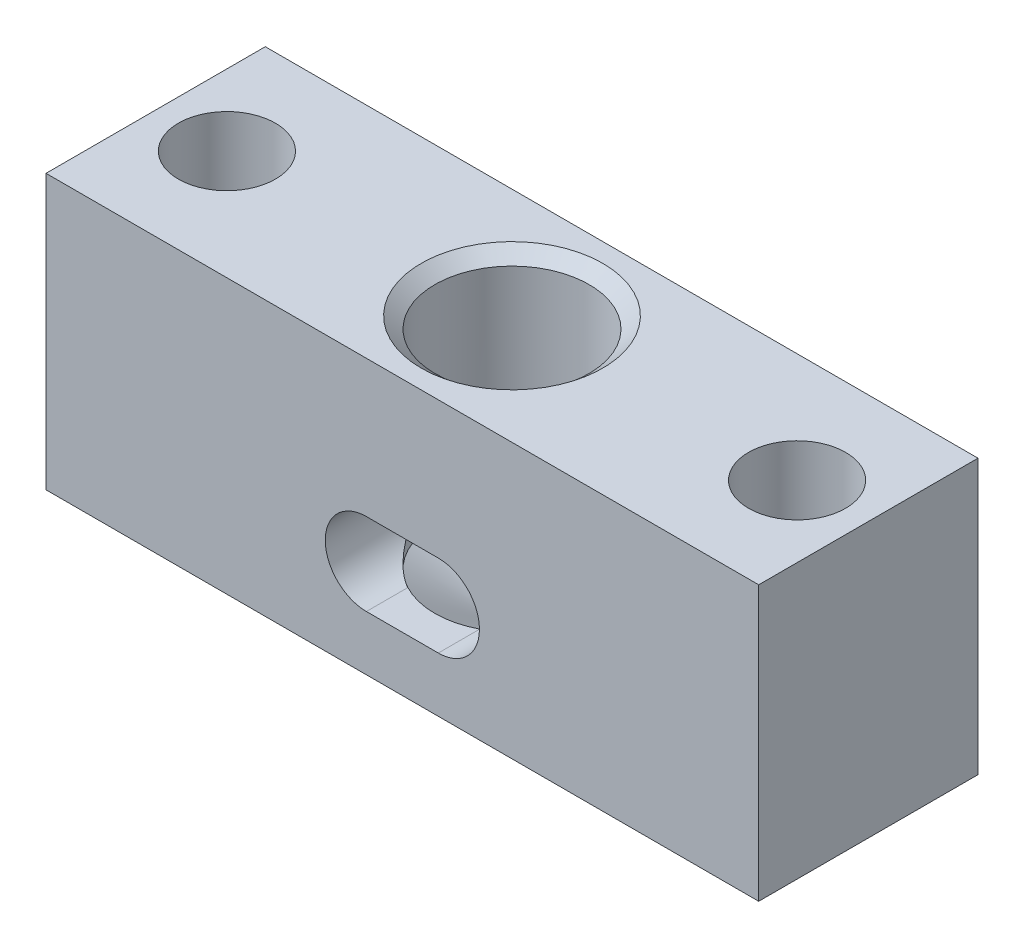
ISO-10303-21;
HEADER;
FILE_DESCRIPTION(('STEP AP214'),'2;1');
FILE_NAME('part.step','',(''),(''),'','','');
FILE_SCHEMA(('AUTOMOTIVE_DESIGN { 1 0 10303 214 1 1 1 1 }'));
ENDSEC;
DATA;
#1=APPLICATION_CONTEXT('core data for automotive mechanical design processes');
#2=APPLICATION_PROTOCOL_DEFINITION('international standard','automotive_design',2000,#1);
#3=PRODUCT_CONTEXT('',#1,'mechanical');
#4=PRODUCT('Part','Part','',(#3));
#5=PRODUCT_RELATED_PRODUCT_CATEGORY('part','',(#4));
#6=PRODUCT_DEFINITION_FORMATION('','',#4);
#7=PRODUCT_DEFINITION_CONTEXT('part definition',#1,'design');
#8=PRODUCT_DEFINITION('design','',#6,#7);
#9=PRODUCT_DEFINITION_SHAPE('','',#8);
#10=(LENGTH_UNIT() NAMED_UNIT(*) SI_UNIT(.MILLI.,.METRE.));
#11=(NAMED_UNIT(*) PLANE_ANGLE_UNIT() SI_UNIT($,.RADIAN.));
#12=(NAMED_UNIT(*) SI_UNIT($,.STERADIAN.) SOLID_ANGLE_UNIT());
#13=UNCERTAINTY_MEASURE_WITH_UNIT(LENGTH_MEASURE(1.E-05),#10,'distance_accuracy_value','');
#14=(GEOMETRIC_REPRESENTATION_CONTEXT(3) GLOBAL_UNCERTAINTY_ASSIGNED_CONTEXT((#13)) GLOBAL_UNIT_ASSIGNED_CONTEXT((#10,
#11,#12)) REPRESENTATION_CONTEXT('',''));
#15=CARTESIAN_POINT('',(0.,0.,0.));
#16=DIRECTION('',(0.,0.,1.));
#17=DIRECTION('',(1.,0.,0.));
#18=AXIS2_PLACEMENT_3D('',#15,#16,#17);
#19=CARTESIAN_POINT('',(-29.3592068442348,20.1742035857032,10.16));
#20=DIRECTION('',(1.,0.,0.));
#21=DIRECTION('',(0.,0.,-1.));
#22=AXIS2_PLACEMENT_3D('',#19,#20,#21);
#23=PLANE('',#22);
#24=DIRECTION('',(0.,-1.,0.));
#25=VECTOR('',#24,1.);
#26=CARTESIAN_POINT('',(-29.3592068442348,20.1742035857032,0.));
#27=LINE('',#26,#25);
#28=CARTESIAN_POINT('',(-29.3592068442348,20.1742035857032,0.));
#29=VERTEX_POINT('',#28);
#30=CARTESIAN_POINT('',(-29.3592068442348,7.47420358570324,0.));
#31=VERTEX_POINT('',#30);
#32=EDGE_CURVE('E230',#29,#31,#27,.T.);
#33=ORIENTED_EDGE('',*,*,#32,.T.);
#34=DIRECTION('',(0.,0.,-1.));
#35=VECTOR('',#34,1.);
#36=CARTESIAN_POINT('',(-29.3592068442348,7.47420358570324,10.16));
#37=LINE('',#36,#35);
#38=CARTESIAN_POINT('',(-29.3592068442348,7.47420358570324,10.16));
#39=VERTEX_POINT('',#38);
#40=EDGE_CURVE('E268',#39,#31,#37,.T.);
#41=ORIENTED_EDGE('',*,*,#40,.F.);
#42=DIRECTION('',(0.,-1.,0.));
#43=VECTOR('',#42,1.);
#44=CARTESIAN_POINT('',(-29.3592068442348,20.1742035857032,10.16));
#45=LINE('',#44,#43);
#46=CARTESIAN_POINT('',(-29.3592068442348,20.1742035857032,10.16));
#47=VERTEX_POINT('',#46);
#48=EDGE_CURVE('E231',#47,#39,#45,.T.);
#49=ORIENTED_EDGE('',*,*,#48,.F.);
#50=DIRECTION('',(0.,0.,-1.));
#51=VECTOR('',#50,1.);
#52=CARTESIAN_POINT('',(-29.3592068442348,20.1742035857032,10.16));
#53=LINE('',#52,#51);
#54=EDGE_CURVE('E245',#47,#29,#53,.T.);
#55=ORIENTED_EDGE('',*,*,#54,.T.);
#56=EDGE_LOOP('',(#33,#41,#49,#55));
#57=FACE_BOUND('',#56,.T.);
#58=ADVANCED_FACE('F42',(#57),#23,.F.);
#59=CARTESIAN_POINT('',(-29.3592068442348,7.47420358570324,10.16));
#60=DIRECTION('',(0.,1.,0.));
#61=DIRECTION('',(0.,0.,1.));
#62=AXIS2_PLACEMENT_3D('',#59,#60,#61);
#63=PLANE('',#62);
#64=CARTESIAN_POINT('',(-26.0572068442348,7.47420358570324,5.08));
#65=DIRECTION('',(0.,1.,0.));
#66=DIRECTION('',(0.,0.,1.));
#67=AXIS2_PLACEMENT_3D('',#64,#65,#66);
#68=CIRCLE('',#67,2.2479);
#69=CARTESIAN_POINT('',(-26.0572068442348,7.47420358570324,7.3279));
#70=VERTEX_POINT('',#69);
#71=EDGE_CURVE('E218',#70,#70,#68,.T.);
#72=ORIENTED_EDGE('',*,*,#71,.T.);
#73=EDGE_LOOP('',(#72));
#74=FACE_BOUND('',#73,.T.);
#75=CARTESIAN_POINT('',(0.358793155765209,7.47420358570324,5.08));
#76=DIRECTION('',(0.,1.,0.));
#77=DIRECTION('',(0.,0.,1.));
#78=AXIS2_PLACEMENT_3D('',#75,#76,#77);
#79=CIRCLE('',#78,2.2479);
#80=CARTESIAN_POINT('',(0.358793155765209,7.47420358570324,7.3279));
#81=VERTEX_POINT('',#80);
#82=EDGE_CURVE('E226',#81,#81,#79,.T.);
#83=ORIENTED_EDGE('',*,*,#82,.T.);
#84=EDGE_LOOP('',(#83));
#85=FACE_BOUND('',#84,.T.);
#86=DIRECTION('',(1.,0.,0.));
#87=VECTOR('',#86,1.);
#88=CARTESIAN_POINT('',(-29.3592068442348,7.47420358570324,0.));
#89=LINE('',#88,#87);
#90=CARTESIAN_POINT('',(3.66079315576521,7.47420358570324,0.));
#91=VERTEX_POINT('',#90);
#92=EDGE_CURVE('E249',#31,#91,#89,.T.);
#93=ORIENTED_EDGE('',*,*,#92,.T.);
#94=DIRECTION('',(0.,0.,-1.));
#95=VECTOR('',#94,1.);
#96=CARTESIAN_POINT('',(3.66079315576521,7.47420358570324,10.16));
#97=LINE('',#96,#95);
#98=CARTESIAN_POINT('',(3.66079315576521,7.47420358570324,10.16));
#99=VERTEX_POINT('',#98);
#100=EDGE_CURVE('E264',#99,#91,#97,.T.);
#101=ORIENTED_EDGE('',*,*,#100,.F.);
#102=DIRECTION('',(1.,0.,0.));
#103=VECTOR('',#102,1.);
#104=CARTESIAN_POINT('',(-29.3592068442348,7.47420358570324,10.16));
#105=LINE('',#104,#103);
#106=EDGE_CURVE('E235',#39,#99,#105,.T.);
#107=ORIENTED_EDGE('',*,*,#106,.F.);
#108=ORIENTED_EDGE('',*,*,#40,.T.);
#109=EDGE_LOOP('',(#93,#101,#107,#108));
#110=FACE_BOUND('',#109,.T.);
#111=ADVANCED_FACE('F326',(#74,#85,#110),#63,.F.);
#112=CARTESIAN_POINT('',(3.66079315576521,20.1742035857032,10.16));
#113=DIRECTION('',(-1.,0.,0.));
#114=DIRECTION('',(0.,0.,1.));
#115=AXIS2_PLACEMENT_3D('',#112,#113,#114);
#116=PLANE('',#115);
#117=DIRECTION('',(0.,1.,0.));
#118=VECTOR('',#117,1.);
#119=CARTESIAN_POINT('',(3.66079315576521,20.1742035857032,0.));
#120=LINE('',#119,#118);
#121=CARTESIAN_POINT('',(3.66079315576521,20.1742035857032,0.));
#122=VERTEX_POINT('',#121);
#123=EDGE_CURVE('E252',#91,#122,#120,.T.);
#124=ORIENTED_EDGE('',*,*,#123,.T.);
#125=DIRECTION('',(0.,0.,-1.));
#126=VECTOR('',#125,1.);
#127=CARTESIAN_POINT('',(3.66079315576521,20.1742035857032,10.16));
#128=LINE('',#127,#126);
#129=CARTESIAN_POINT('',(3.66079315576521,20.1742035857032,10.16));
#130=VERTEX_POINT('',#129);
#131=EDGE_CURVE('E260',#130,#122,#128,.T.);
#132=ORIENTED_EDGE('',*,*,#131,.F.);
#133=DIRECTION('',(0.,1.,0.));
#134=VECTOR('',#133,1.);
#135=CARTESIAN_POINT('',(3.66079315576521,20.1742035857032,10.16));
#136=LINE('',#135,#134);
#137=EDGE_CURVE('E239',#99,#130,#136,.T.);
#138=ORIENTED_EDGE('',*,*,#137,.F.);
#139=ORIENTED_EDGE('',*,*,#100,.T.);
#140=EDGE_LOOP('',(#124,#132,#138,#139));
#141=FACE_BOUND('',#140,.T.);
#142=ADVANCED_FACE('F331',(#141),#116,.F.);
#143=CARTESIAN_POINT('',(-29.3592068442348,20.1742035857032,10.16));
#144=DIRECTION('',(0.,-1.,0.));
#145=DIRECTION('',(0.,0.,-1.));
#146=AXIS2_PLACEMENT_3D('',#143,#144,#145);
#147=PLANE('',#146);
#148=CARTESIAN_POINT('',(-12.8492068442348,20.1742035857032,5.08));
#149=DIRECTION('',(0.,1.,0.));
#150=DIRECTION('',(0.,0.,1.));
#151=AXIS2_PLACEMENT_3D('',#148,#149,#150);
#152=CIRCLE('',#151,4.206875);
#153=CARTESIAN_POINT('',(-12.8492068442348,20.1742035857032,9.286875));
#154=VERTEX_POINT('',#153);
#155=EDGE_CURVE('E192',#154,#154,#152,.T.);
#156=ORIENTED_EDGE('',*,*,#155,.F.);
#157=EDGE_LOOP('',(#156));
#158=FACE_BOUND('',#157,.T.);
#159=CARTESIAN_POINT('',(-26.0572068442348,20.1742035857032,5.08));
#160=DIRECTION('',(0.,1.,0.));
#161=DIRECTION('',(0.,0.,1.));
#162=AXIS2_PLACEMENT_3D('',#159,#160,#161);
#163=CIRCLE('',#162,2.2479);
#164=CARTESIAN_POINT('',(-26.0572068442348,20.1742035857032,7.3279));
#165=VERTEX_POINT('',#164);
#166=EDGE_CURVE('E213',#165,#165,#163,.T.);
#167=ORIENTED_EDGE('',*,*,#166,.F.);
#168=EDGE_LOOP('',(#167));
#169=FACE_BOUND('',#168,.T.);
#170=CARTESIAN_POINT('',(0.358793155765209,20.1742035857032,5.08));
#171=DIRECTION('',(0.,1.,0.));
#172=DIRECTION('',(0.,0.,1.));
#173=AXIS2_PLACEMENT_3D('',#170,#171,#172);
#174=CIRCLE('',#173,2.2479);
#175=CARTESIAN_POINT('',(0.358793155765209,20.1742035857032,7.3279));
#176=VERTEX_POINT('',#175);
#177=EDGE_CURVE('E222',#176,#176,#174,.T.);
#178=ORIENTED_EDGE('',*,*,#177,.F.);
#179=EDGE_LOOP('',(#178));
#180=FACE_BOUND('',#179,.T.);
#181=DIRECTION('',(-1.,0.,0.));
#182=VECTOR('',#181,1.);
#183=CARTESIAN_POINT('',(-29.3592068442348,20.1742035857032,0.));
#184=LINE('',#183,#182);
#185=EDGE_CURVE('E236',#122,#29,#184,.T.);
#186=ORIENTED_EDGE('',*,*,#185,.T.);
#187=ORIENTED_EDGE('',*,*,#54,.F.);
#188=DIRECTION('',(-1.,0.,0.));
#189=VECTOR('',#188,1.);
#190=CARTESIAN_POINT('',(-29.3592068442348,20.1742035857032,10.16));
#191=LINE('',#190,#189);
#192=EDGE_CURVE('E242',#130,#47,#191,.T.);
#193=ORIENTED_EDGE('',*,*,#192,.F.);
#194=ORIENTED_EDGE('',*,*,#131,.T.);
#195=EDGE_LOOP('',(#186,#187,#193,#194));
#196=FACE_BOUND('',#195,.T.);
#197=ADVANCED_FACE('F347',(#158,#169,#180,#196),#147,.F.);
#198=CARTESIAN_POINT('',(0.,0.,10.16));
#199=DIRECTION('',(0.,0.,1.));
#200=DIRECTION('',(1.,0.,0.));
#201=AXIS2_PLACEMENT_3D('',#198,#199,#200);
#202=PLANE('',#201);
#203=CARTESIAN_POINT('',(-14.5154468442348,11.9192035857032,10.16));
#204=DIRECTION('',(0.,0.,1.));
#205=DIRECTION('',(1.,0.,0.));
#206=AXIS2_PLACEMENT_3D('',#203,#204,#205);
#207=CIRCLE('',#206,1.905);
#208=CARTESIAN_POINT('',(-14.5154468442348,13.8242035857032,10.16));
#209=VERTEX_POINT('',#208);
#210=CARTESIAN_POINT('',(-14.5154468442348,10.0142035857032,10.16));
#211=VERTEX_POINT('',#210);
#212=EDGE_CURVE('E63',#209,#211,#207,.T.);
#213=ORIENTED_EDGE('',*,*,#212,.F.);
#214=DIRECTION('',(-1.,0.,0.));
#215=VECTOR('',#214,1.);
#216=CARTESIAN_POINT('',(-14.5154468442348,13.8242035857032,10.16));
#217=LINE('',#216,#215);
#218=CARTESIAN_POINT('',(-11.1829668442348,13.8242035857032,10.16));
#219=VERTEX_POINT('',#218);
#220=EDGE_CURVE('E168',#219,#209,#217,.T.);
#221=ORIENTED_EDGE('',*,*,#220,.F.);
#222=CARTESIAN_POINT('',(-11.1829668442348,11.9192035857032,10.16));
#223=DIRECTION('',(0.,0.,1.));
#224=DIRECTION('',(1.,0.,0.));
#225=AXIS2_PLACEMENT_3D('',#222,#223,#224);
#226=CIRCLE('',#225,1.905);
#227=CARTESIAN_POINT('',(-11.1829668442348,10.0142035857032,10.16));
#228=VERTEX_POINT('',#227);
#229=EDGE_CURVE('E173',#228,#219,#226,.T.);
#230=ORIENTED_EDGE('',*,*,#229,.F.);
#231=DIRECTION('',(1.,0.,0.));
#232=VECTOR('',#231,1.);
#233=CARTESIAN_POINT('',(-14.5154468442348,10.0142035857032,10.16));
#234=LINE('',#233,#232);
#235=EDGE_CURVE('E182',#211,#228,#234,.T.);
#236=ORIENTED_EDGE('',*,*,#235,.F.);
#237=EDGE_LOOP('',(#213,#221,#230,#236));
#238=FACE_BOUND('',#237,.T.);
#239=ORIENTED_EDGE('',*,*,#48,.T.);
#240=ORIENTED_EDGE('',*,*,#106,.T.);
#241=ORIENTED_EDGE('',*,*,#137,.T.);
#242=ORIENTED_EDGE('',*,*,#192,.T.);
#243=EDGE_LOOP('',(#239,#240,#241,#242));
#244=FACE_BOUND('',#243,.T.);
#245=ADVANCED_FACE('F343',(#238,#244),#202,.T.);
#246=CARTESIAN_POINT('',(0.,0.,0.));
#247=DIRECTION('',(0.,0.,1.));
#248=DIRECTION('',(1.,0.,0.));
#249=AXIS2_PLACEMENT_3D('',#246,#247,#248);
#250=PLANE('',#249);
#251=DIRECTION('',(-1.,0.,0.));
#252=VECTOR('',#251,1.);
#253=CARTESIAN_POINT('',(-14.5154468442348,13.8242035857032,0.));
#254=LINE('',#253,#252);
#255=CARTESIAN_POINT('',(-11.1829668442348,13.8242035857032,0.));
#256=VERTEX_POINT('',#255);
#257=CARTESIAN_POINT('',(-14.5154468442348,13.8242035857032,0.));
#258=VERTEX_POINT('',#257);
#259=EDGE_CURVE('E166',#256,#258,#254,.T.);
#260=ORIENTED_EDGE('',*,*,#259,.T.);
#261=CARTESIAN_POINT('',(-14.5154468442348,11.9192035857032,0.));
#262=DIRECTION('',(0.,0.,1.));
#263=DIRECTION('',(1.,0.,0.));
#264=AXIS2_PLACEMENT_3D('',#261,#262,#263);
#265=CIRCLE('',#264,1.905);
#266=CARTESIAN_POINT('',(-14.5154468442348,10.0142035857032,0.));
#267=VERTEX_POINT('',#266);
#268=EDGE_CURVE('E148',#258,#267,#265,.T.);
#269=ORIENTED_EDGE('',*,*,#268,.T.);
#270=DIRECTION('',(1.,0.,0.));
#271=VECTOR('',#270,1.);
#272=CARTESIAN_POINT('',(-14.5154468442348,10.0142035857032,0.));
#273=LINE('',#272,#271);
#274=CARTESIAN_POINT('',(-11.1829668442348,10.0142035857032,0.));
#275=VERTEX_POINT('',#274);
#276=EDGE_CURVE('E157',#267,#275,#273,.T.);
#277=ORIENTED_EDGE('',*,*,#276,.T.);
#278=CARTESIAN_POINT('',(-11.1829668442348,11.9192035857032,0.));
#279=DIRECTION('',(0.,0.,1.));
#280=DIRECTION('',(1.,0.,0.));
#281=AXIS2_PLACEMENT_3D('',#278,#279,#280);
#282=CIRCLE('',#281,1.905);
#283=EDGE_CURVE('E71',#275,#256,#282,.T.);
#284=ORIENTED_EDGE('',*,*,#283,.T.);
#285=EDGE_LOOP('',(#260,#269,#277,#284));
#286=FACE_BOUND('',#285,.T.);
#287=ORIENTED_EDGE('',*,*,#32,.F.);
#288=ORIENTED_EDGE('',*,*,#185,.F.);
#289=ORIENTED_EDGE('',*,*,#123,.F.);
#290=ORIENTED_EDGE('',*,*,#92,.F.);
#291=EDGE_LOOP('',(#287,#288,#289,#290));
#292=FACE_BOUND('',#291,.T.);
#293=ADVANCED_FACE('F163',(#286,#292),#250,.F.);
#294=CARTESIAN_POINT('',(0.358793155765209,20.1742035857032,5.08));
#295=DIRECTION('',(0.,1.,0.));
#296=DIRECTION('',(0.,0.,1.));
#297=AXIS2_PLACEMENT_3D('',#294,#295,#296);
#298=CYLINDRICAL_SURFACE('',#297,2.2479);
#299=ORIENTED_EDGE('',*,*,#82,.F.);
#300=EDGE_LOOP('',(#299));
#301=FACE_BOUND('',#300,.T.);
#302=ORIENTED_EDGE('',*,*,#177,.T.);
#303=EDGE_LOOP('',(#302));
#304=FACE_BOUND('',#303,.T.);
#305=ADVANCED_FACE('F359',(#301,#304),#298,.F.);
#306=CARTESIAN_POINT('',(-26.0572068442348,20.1742035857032,5.08));
#307=DIRECTION('',(0.,1.,0.));
#308=DIRECTION('',(0.,0.,1.));
#309=AXIS2_PLACEMENT_3D('',#306,#307,#308);
#310=CYLINDRICAL_SURFACE('',#309,2.2479);
#311=ORIENTED_EDGE('',*,*,#71,.F.);
#312=EDGE_LOOP('',(#311));
#313=FACE_BOUND('',#312,.T.);
#314=ORIENTED_EDGE('',*,*,#166,.T.);
#315=EDGE_LOOP('',(#314));
#316=FACE_BOUND('',#315,.T.);
#317=ADVANCED_FACE('F365',(#313,#316),#310,.F.);
#318=CARTESIAN_POINT('',(-12.8492068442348,10.0142035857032,5.08));
#319=DIRECTION('',(0.,1.,0.));
#320=DIRECTION('',(0.,0.,1.));
#321=AXIS2_PLACEMENT_3D('',#318,#319,#320);
#322=CONICAL_SURFACE('',#321,3.571875,1.02974425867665);
#323=CARTESIAN_POINT('',(-12.8492068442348,7.86800456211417,5.08));
#324=VERTEX_POINT('',#323);
#325=VERTEX_LOOP('',#324);
#326=FACE_BOUND('',#325,.T.);
#327=CARTESIAN_POINT('',(-12.8492068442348,10.0142035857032,5.08));
#328=DIRECTION('',(0.,1.,0.));
#329=DIRECTION('',(0.,0.,1.));
#330=AXIS2_PLACEMENT_3D('',#327,#328,#329);
#331=CIRCLE('',#330,3.571875);
#332=CARTESIAN_POINT('',(-11.1829668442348,10.0142035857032,8.23942008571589));
#333=VERTEX_POINT('',#332);
#334=CARTESIAN_POINT('',(-11.1829668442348,10.0142035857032,1.92057991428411));
#335=VERTEX_POINT('',#334);
#336=EDGE_CURVE('E209',#333,#335,#331,.T.);
#337=ORIENTED_EDGE('',*,*,#336,.T.);
#338=CARTESIAN_POINT('',(-14.5154468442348,10.0142035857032,1.92057991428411));
#339=VERTEX_POINT('',#338);
#340=EDGE_CURVE('E214',#335,#339,#331,.T.);
#341=ORIENTED_EDGE('',*,*,#340,.T.);
#342=CARTESIAN_POINT('',(-14.5154468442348,10.0142035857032,8.23942008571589));
#343=VERTEX_POINT('',#342);
#344=EDGE_CURVE('E383',#339,#343,#331,.T.);
#345=ORIENTED_EDGE('',*,*,#344,.T.);
#346=EDGE_CURVE('E208',#343,#333,#331,.T.);
#347=ORIENTED_EDGE('',*,*,#346,.T.);
#348=EDGE_LOOP('',(#337,#341,#345,#347));
#349=FACE_BOUND('',#348,.T.);
#350=ADVANCED_FACE('F321',(#326,#349),#322,.F.);
#351=CARTESIAN_POINT('',(-12.8492068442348,20.1742035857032,5.08));
#352=DIRECTION('',(0.,1.,0.));
#353=DIRECTION('',(0.,0.,1.));
#354=AXIS2_PLACEMENT_3D('',#351,#352,#353);
#355=CYLINDRICAL_SURFACE('',#354,3.571875);
#356=ORIENTED_EDGE('',*,*,#344,.F.);
#357=CARTESIAN_POINT('',(-14.5154468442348,10.0142035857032,1.92057991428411));
#358=CARTESIAN_POINT('',(-14.574978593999,10.0142003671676,1.95196004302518));
#359=CARTESIAN_POINT('',(-14.6335671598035,10.0169928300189,1.98502460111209));
#360=CARTESIAN_POINT('',(-14.7483639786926,10.0276203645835,2.05412060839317));
#361=CARTESIAN_POINT('',(-14.8045761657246,10.0354467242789,2.09014683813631));
#362=CARTESIAN_POINT('',(-14.9137719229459,10.0554937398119,2.16449188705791));
#363=CARTESIAN_POINT('',(-14.9667826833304,10.0676685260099,2.20278341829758));
#364=CARTESIAN_POINT('',(-15.0699920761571,10.0959184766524,2.28167367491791));
#365=CARTESIAN_POINT('',(-15.1201891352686,10.1119957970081,2.32227366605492));
#366=CARTESIAN_POINT('',(-15.2953993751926,10.1759774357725,2.47192478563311));
#367=CARTESIAN_POINT('',(-15.4119759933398,10.2337297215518,2.58682105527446));
#368=CARTESIAN_POINT('',(-15.6249942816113,10.3655791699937,2.82628737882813));
#369=CARTESIAN_POINT('',(-15.7213226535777,10.4397637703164,2.95090678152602));
#370=CARTESIAN_POINT('',(-15.8685019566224,10.5756657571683,3.16848153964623));
#371=CARTESIAN_POINT('',(-15.9243708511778,10.6345642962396,3.25987823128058));
#372=CARTESIAN_POINT('',(-16.0267099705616,10.7566798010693,3.44507939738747));
#373=CARTESIAN_POINT('',(-16.0731759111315,10.8198987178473,3.53888494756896));
#374=CARTESIAN_POINT('',(-16.1570087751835,10.9495383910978,3.72816989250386));
#375=CARTESIAN_POINT('',(-16.1943832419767,11.0159564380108,3.8236478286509));
#376=CARTESIAN_POINT('',(-16.2603929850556,11.1511852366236,4.01585021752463));
#377=CARTESIAN_POINT('',(-16.2890314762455,11.2199950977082,4.11257419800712));
#378=CARTESIAN_POINT('',(-16.3381899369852,11.3604265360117,4.30823343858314));
#379=CARTESIAN_POINT('',(-16.3585872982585,11.432074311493,4.40718049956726));
#380=CARTESIAN_POINT('',(-16.3908291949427,11.5764605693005,4.60542083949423));
#381=CARTESIAN_POINT('',(-16.4026879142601,11.6491970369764,4.70471326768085));
#382=CARTESIAN_POINT('',(-16.4127819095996,11.7468575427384,4.83462059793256));
#383=CARTESIAN_POINT('',(-16.4147920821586,11.7705477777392,4.86587676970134));
#384=CARTESIAN_POINT('',(-16.4173280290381,11.8092670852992,4.91524257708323));
#385=CARTESIAN_POINT('',(-16.418125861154,11.8239640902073,4.93360281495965));
#386=CARTESIAN_POINT('',(-16.4191605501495,11.8485844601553,4.96236606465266));
#387=CARTESIAN_POINT('',(-16.4194947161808,11.8581212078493,4.97306749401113));
#388=CARTESIAN_POINT('',(-16.4199058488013,11.8735118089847,4.98820368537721));
#389=CARTESIAN_POINT('',(-16.4200285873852,11.8788786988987,4.99313835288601));
#390=CARTESIAN_POINT('',(-16.4202359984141,11.8902943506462,5.00215019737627));
#391=CARTESIAN_POINT('',(-16.4203211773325,11.896332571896,5.00623836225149));
#392=CARTESIAN_POINT('',(-16.4203977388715,11.9053271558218,5.01008657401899));
#393=CARTESIAN_POINT('',(-16.4204142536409,11.9077801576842,5.01094161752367));
#394=CARTESIAN_POINT('',(-16.4204377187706,11.9127979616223,5.01216635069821));
#395=CARTESIAN_POINT('',(-16.4204447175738,11.9153621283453,5.01253849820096));
#396=CARTESIAN_POINT('',(-16.4204481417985,11.9205315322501,5.01271968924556));
#397=CARTESIAN_POINT('',(-16.4204444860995,11.9231369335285,5.01252441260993));
#398=CARTESIAN_POINT('',(-16.4204270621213,11.9282590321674,5.01160879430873));
#399=CARTESIAN_POINT('',(-16.4204132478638,11.9307752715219,5.01088606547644));
#400=CARTESIAN_POINT('',(-16.4203707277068,11.9365603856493,5.00871872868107));
#401=CARTESIAN_POINT('',(-16.4203384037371,11.9397634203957,5.00710599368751));
#402=CARTESIAN_POINT('',(-16.4202620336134,11.9459141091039,5.00345335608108));
#403=CARTESIAN_POINT('',(-16.4202179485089,11.9488608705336,5.0014120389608));
#404=CARTESIAN_POINT('',(-16.4199730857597,11.9632555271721,4.99060486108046));
#405=CARTESIAN_POINT('',(-16.4197023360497,11.9734023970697,4.9802081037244));
#406=CARTESIAN_POINT('',(-16.4190417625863,11.9929702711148,4.95878098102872));
#407=CARTESIAN_POINT('',(-16.4186511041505,12.0023855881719,4.94774662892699));
#408=CARTESIAN_POINT('',(-16.4164354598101,12.048130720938,4.89273718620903));
#409=CARTESIAN_POINT('',(-16.4137633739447,12.0824337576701,4.8470381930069));
#410=CARTESIAN_POINT('',(-16.4066217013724,12.150758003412,4.75556802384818));
#411=CARTESIAN_POINT('',(-16.4021490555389,12.1847786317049,4.70979685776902));
#412=CARTESIAN_POINT('',(-16.3859319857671,12.2867953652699,4.57161488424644));
#413=CARTESIAN_POINT('',(-16.3714156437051,12.3542062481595,4.47904770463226));
#414=CARTESIAN_POINT('',(-16.3349289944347,12.487774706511,4.29456568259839));
#415=CARTESIAN_POINT('',(-16.31296153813,12.5539327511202,4.20265060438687));
#416=CARTESIAN_POINT('',(-16.2612831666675,12.68474716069,4.01928026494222));
#417=CARTESIAN_POINT('',(-16.2315390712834,12.7493957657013,3.92782872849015));
#418=CARTESIAN_POINT('',(-16.1641168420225,12.8763208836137,3.74618843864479));
#419=CARTESIAN_POINT('',(-16.1264380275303,12.9385971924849,3.65599979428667));
#420=CARTESIAN_POINT('',(-16.0425091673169,13.0605322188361,3.47656550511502));
#421=CARTESIAN_POINT('',(-15.9961896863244,13.1201645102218,3.38733417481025));
#422=CARTESIAN_POINT('',(-15.8948483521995,13.23531920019,3.21112574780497));
#423=CARTESIAN_POINT('',(-15.8398246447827,13.2908407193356,3.12414913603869));
#424=CARTESIAN_POINT('',(-15.7209032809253,13.3964326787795,2.95339621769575));
#425=CARTESIAN_POINT('',(-15.6570305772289,13.4465177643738,2.86961172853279));
#426=CARTESIAN_POINT('',(-15.5200778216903,13.5398828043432,2.70595064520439));
#427=CARTESIAN_POINT('',(-15.4470057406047,13.583168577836,2.62607075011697));
#428=CARTESIAN_POINT('',(-15.2781817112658,13.6678173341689,2.45799949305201));
#429=CARTESIAN_POINT('',(-15.1806885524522,13.7075833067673,2.3707254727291));
#430=CARTESIAN_POINT('',(-14.9736637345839,13.7714201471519,2.20556821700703));
#431=CARTESIAN_POINT('',(-14.8641793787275,13.7955502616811,2.12765045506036));
#432=CARTESIAN_POINT('',(-14.7117739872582,13.8144488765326,2.03185764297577));
#433=CARTESIAN_POINT('',(-14.6731895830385,13.8180654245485,2.00861320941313));
#434=CARTESIAN_POINT('',(-14.5950273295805,13.822943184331,1.96352213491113));
#435=CARTESIAN_POINT('',(-14.555448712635,13.824202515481,1.94167662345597));
#436=CARTESIAN_POINT('',(-14.5154468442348,13.8242035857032,1.92057991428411));
#437=B_SPLINE_CURVE_WITH_KNOTS('',3,(#357,#358,#359,#360,#361,#362,#363,#364,#365,#366,#367,
#368,#369,#370,#371,#372,#373,#374,#375,#376,#377,#378,#379,#380,#381,#382,#383,#384,#385,#386,
#387,#388,#389,#390,#391,#392,#393,#394,#395,#396,#397,#398,#399,#400,#401,#402,#403,#404,#405,
#406,#407,#408,#409,#410,#411,#412,#413,#414,#415,#416,#417,#418,#419,#420,#421,#422,#423,#424,
#425,#426,#427,#428,#429,#430,#431,#432,#433,#434,#435,#436),.UNSPECIFIED.,.F.,.F.,(4,2,2,2,2,2,
2,2,2,2,2,2,2,2,2,2,2,2,2,2,2,2,2,2,2,2,2,2,2,2,2,2,2,2,2,2,2,2,2,4),(0.,0.201731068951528,
0.403113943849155,0.602432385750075,0.801861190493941,1.31953245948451,1.84002745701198,
2.20630072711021,2.57274050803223,2.93887520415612,3.30487499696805,3.67613549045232,
4.04677783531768,4.16456710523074,4.23517099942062,4.27810357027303,4.29998547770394,
4.32156255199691,4.32931872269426,4.33703525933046,4.34481070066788,4.35262155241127,
4.3633213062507,4.3740569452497,4.41732792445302,4.4609072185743,4.63226123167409,
4.80390760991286,5.14987983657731,5.49571983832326,5.84306020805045,6.1904303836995,
6.54072265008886,6.89108964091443,7.24048803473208,7.58958575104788,7.99843120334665,
8.4057182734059,8.54121180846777,8.6768133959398),.UNSPECIFIED.);
#438=CARTESIAN_POINT('',(-14.5154468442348,13.8242035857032,1.92057991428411));
#439=VERTEX_POINT('',#438);
#440=EDGE_CURVE('E11',#339,#439,#437,.T.);
#441=ORIENTED_EDGE('',*,*,#440,.T.);
#442=CARTESIAN_POINT('',(-12.8492068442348,13.8242035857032,5.08));
#443=DIRECTION('',(0.,1.,0.));
#444=DIRECTION('',(0.,0.,1.));
#445=AXIS2_PLACEMENT_3D('',#442,#443,#444);
#446=CIRCLE('',#445,3.571875);
#447=CARTESIAN_POINT('',(-11.1829668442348,13.8242035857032,1.92057991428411));
#448=VERTEX_POINT('',#447);
#449=EDGE_CURVE('E56',#439,#448,#446,.F.);
#450=ORIENTED_EDGE('',*,*,#449,.T.);
#451=CARTESIAN_POINT('',(-11.1829668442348,13.8242035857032,1.92057991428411));
#452=CARTESIAN_POINT('',(-11.1234350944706,13.8242068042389,1.95196004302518));
#453=CARTESIAN_POINT('',(-11.0648465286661,13.8214143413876,1.98502460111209));
#454=CARTESIAN_POINT('',(-10.950049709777,13.810786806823,2.05412060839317));
#455=CARTESIAN_POINT('',(-10.893837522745,13.8029604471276,2.09014683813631));
#456=CARTESIAN_POINT('',(-10.7846417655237,13.7829134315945,2.16449188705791));
#457=CARTESIAN_POINT('',(-10.7316310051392,13.7707386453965,2.20278341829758));
#458=CARTESIAN_POINT('',(-10.6284216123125,13.7424886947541,2.28167367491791));
#459=CARTESIAN_POINT('',(-10.578224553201,13.7264113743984,2.32227366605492));
#460=CARTESIAN_POINT('',(-10.403014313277,13.6624297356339,2.47192478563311));
#461=CARTESIAN_POINT('',(-10.2864376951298,13.6046774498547,2.58682105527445));
#462=CARTESIAN_POINT('',(-10.0734194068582,13.4728280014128,2.82628737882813));
#463=CARTESIAN_POINT('',(-9.97709103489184,13.3986434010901,2.95090678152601));
#464=CARTESIAN_POINT('',(-9.82991173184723,13.2627414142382,3.16848153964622));
#465=CARTESIAN_POINT('',(-9.77404283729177,13.2038428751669,3.25987823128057));
#466=CARTESIAN_POINT('',(-9.67170371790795,13.0817273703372,3.44507939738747));
#467=CARTESIAN_POINT('',(-9.62523777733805,13.0185084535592,3.53888494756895));
#468=CARTESIAN_POINT('',(-9.54140491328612,12.8888687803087,3.72816989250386));
#469=CARTESIAN_POINT('',(-9.50403044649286,12.8224507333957,3.82364782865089));
#470=CARTESIAN_POINT('',(-9.43802070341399,12.6872219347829,4.01585021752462));
#471=CARTESIAN_POINT('',(-9.40938221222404,12.6184120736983,4.11257419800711));
#472=CARTESIAN_POINT('',(-9.36022375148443,12.4779806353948,4.30823343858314));
#473=CARTESIAN_POINT('',(-9.33982639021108,12.4063328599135,4.40718049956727));
#474=CARTESIAN_POINT('',(-9.3075844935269,12.261946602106,4.60542083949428));
#475=CARTESIAN_POINT('',(-9.29572577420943,12.1892101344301,4.70471326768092));
#476=CARTESIAN_POINT('',(-9.28563177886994,12.0915496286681,4.83462059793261));
#477=CARTESIAN_POINT('',(-9.28362160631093,12.0678593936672,4.86587676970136));
#478=CARTESIAN_POINT('',(-9.28108565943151,12.0291400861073,4.91524257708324));
#479=CARTESIAN_POINT('',(-9.28028782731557,12.0144430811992,4.93360281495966));
#480=CARTESIAN_POINT('',(-9.27925313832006,11.9898227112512,4.96236606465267));
#481=CARTESIAN_POINT('',(-9.27891897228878,11.9802859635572,4.97306749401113));
#482=CARTESIAN_POINT('',(-9.27850783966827,11.9648953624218,4.98820368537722));
#483=CARTESIAN_POINT('',(-9.2783851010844,11.9595284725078,4.99313835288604));
#484=CARTESIAN_POINT('',(-9.27817769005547,11.9481128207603,5.00215019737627));
#485=CARTESIAN_POINT('',(-9.27809251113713,11.9420745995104,5.00623836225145));
#486=CARTESIAN_POINT('',(-9.27801594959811,11.9330800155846,5.01008657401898));
#487=CARTESIAN_POINT('',(-9.27799943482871,11.9306270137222,5.01094161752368));
#488=CARTESIAN_POINT('',(-9.277975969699,11.9256092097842,5.01216635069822));
#489=CARTESIAN_POINT('',(-9.27796897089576,11.9230450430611,5.01253849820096));
#490=CARTESIAN_POINT('',(-9.27796554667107,11.9178756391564,5.01271968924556));
#491=CARTESIAN_POINT('',(-9.27796920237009,11.915270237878,5.01252441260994));
#492=CARTESIAN_POINT('',(-9.27798662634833,11.9101481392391,5.01160879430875));
#493=CARTESIAN_POINT('',(-9.27800044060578,11.9076318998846,5.01088606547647));
#494=CARTESIAN_POINT('',(-9.27804296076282,11.9018467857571,5.00871872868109));
#495=CARTESIAN_POINT('',(-9.27807528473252,11.8986437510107,5.00710599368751));
#496=CARTESIAN_POINT('',(-9.27815165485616,11.8924930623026,5.00345335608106));
#497=CARTESIAN_POINT('',(-9.27819573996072,11.8895463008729,5.00141203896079));
#498=CARTESIAN_POINT('',(-9.27844060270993,11.8751516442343,4.99060486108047));
#499=CARTESIAN_POINT('',(-9.27871135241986,11.8650047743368,4.98020810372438));
#500=CARTESIAN_POINT('',(-9.2793719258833,11.8454369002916,4.95878098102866));
#501=CARTESIAN_POINT('',(-9.27976258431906,11.8360215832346,4.94774662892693));
#502=CARTESIAN_POINT('',(-9.28197822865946,11.7902764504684,4.89273718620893));
#503=CARTESIAN_POINT('',(-9.28465031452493,11.7559734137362,4.84703819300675));
#504=CARTESIAN_POINT('',(-9.29179198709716,11.6876491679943,4.75556802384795));
#505=CARTESIAN_POINT('',(-9.29626463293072,11.6536285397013,4.70979685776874));
#506=CARTESIAN_POINT('',(-9.31248170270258,11.5516118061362,4.57161488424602));
#507=CARTESIAN_POINT('',(-9.3269980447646,11.4842009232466,4.47904770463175));
#508=CARTESIAN_POINT('',(-9.36348469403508,11.350632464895,4.2945656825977));
#509=CARTESIAN_POINT('',(-9.38545215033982,11.2844744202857,4.20265060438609));
#510=CARTESIAN_POINT('',(-9.43713052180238,11.1536600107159,4.01928026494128));
#511=CARTESIAN_POINT('',(-9.46687461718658,11.0890114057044,3.92782872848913));
#512=CARTESIAN_POINT('',(-9.53429684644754,10.962086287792,3.74618843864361));
#513=CARTESIAN_POINT('',(-9.57197566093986,10.8998099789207,3.65599979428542));
#514=CARTESIAN_POINT('',(-9.65590452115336,10.7778749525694,3.47656550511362));
#515=CARTESIAN_POINT('',(-9.70222400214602,10.7182426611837,3.38733417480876));
#516=CARTESIAN_POINT('',(-9.80356533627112,10.6030879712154,3.21112574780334));
#517=CARTESIAN_POINT('',(-9.85858904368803,10.5475664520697,3.12414913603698));
#518=CARTESIAN_POINT('',(-9.9775104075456,10.4419744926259,2.95339621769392));
#519=CARTESIAN_POINT('',(-10.0413831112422,10.3918894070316,2.8696117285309));
#520=CARTESIAN_POINT('',(-10.1783358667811,10.2985243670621,2.70595064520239));
#521=CARTESIAN_POINT('',(-10.2514079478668,10.2552385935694,2.62607075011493));
#522=CARTESIAN_POINT('',(-10.4202319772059,10.1705898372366,2.45799949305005));
#523=CARTESIAN_POINT('',(-10.5177251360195,10.1308238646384,2.37072547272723));
#524=CARTESIAN_POINT('',(-10.7247499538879,10.066987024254,2.20556821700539));
#525=CARTESIAN_POINT('',(-10.8342343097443,10.0428569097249,2.12765045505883));
#526=CARTESIAN_POINT('',(-10.9866397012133,10.0239582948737,2.03185764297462));
#527=CARTESIAN_POINT('',(-11.0252241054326,10.0203417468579,2.00861320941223));
#528=CARTESIAN_POINT('',(-11.1033863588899,10.0154639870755,1.9635221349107));
#529=CARTESIAN_POINT('',(-11.142964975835,10.0142046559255,1.94167662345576));
#530=CARTESIAN_POINT('',(-11.1829668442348,10.0142035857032,1.92057991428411));
#531=B_SPLINE_CURVE_WITH_KNOTS('',3,(#451,#452,#453,#454,#455,#456,#457,#458,#459,#460,#461,
#462,#463,#464,#465,#466,#467,#468,#469,#470,#471,#472,#473,#474,#475,#476,#477,#478,#479,#480,
#481,#482,#483,#484,#485,#486,#487,#488,#489,#490,#491,#492,#493,#494,#495,#496,#497,#498,#499,
#500,#501,#502,#503,#504,#505,#506,#507,#508,#509,#510,#511,#512,#513,#514,#515,#516,#517,#518,
#519,#520,#521,#522,#523,#524,#525,#526,#527,#528,#529,#530),.UNSPECIFIED.,.F.,.F.,(4,2,2,2,2,2,
2,2,2,2,2,2,2,2,2,2,2,2,2,2,2,2,2,2,2,2,2,2,2,2,2,2,2,2,2,2,2,2,2,4),(0.,0.201731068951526,
0.403113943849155,0.602432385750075,0.801861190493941,1.31953245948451,1.84002745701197,
2.20630072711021,2.57274050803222,2.93887520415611,3.30487499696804,3.67613549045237,
4.04677783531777,4.16456710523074,4.23517099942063,4.27810357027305,4.29998547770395,
4.32156255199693,4.32931872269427,4.33703525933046,4.34481070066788,4.35262155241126,
4.3633213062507,4.37405694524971,4.41732792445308,4.46090721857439,4.63226123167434,
4.80390760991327,5.14987983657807,5.49571983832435,5.84306020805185,6.19043038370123,
6.54072265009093,6.89108964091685,7.24048803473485,7.58958575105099,7.99843120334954,
8.40571827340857,8.54121180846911,8.6768133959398),.UNSPECIFIED.);
#532=EDGE_CURVE('E296',#448,#335,#531,.T.);
#533=ORIENTED_EDGE('',*,*,#532,.T.);
#534=ORIENTED_EDGE('',*,*,#336,.F.);
#535=CARTESIAN_POINT('',(-11.1829668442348,10.0142035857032,8.23942008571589));
#536=CARTESIAN_POINT('',(-11.1234350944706,10.0142003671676,8.20803995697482));
#537=CARTESIAN_POINT('',(-11.0648465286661,10.0169928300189,8.17497539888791));
#538=CARTESIAN_POINT('',(-10.950049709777,10.0276203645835,8.10587939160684));
#539=CARTESIAN_POINT('',(-10.893837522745,10.0354467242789,8.06985316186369));
#540=CARTESIAN_POINT('',(-10.7846417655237,10.0554937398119,7.99550811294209));
#541=CARTESIAN_POINT('',(-10.7316310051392,10.0676685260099,7.95721658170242));
#542=CARTESIAN_POINT('',(-10.6284216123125,10.0959184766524,7.87832632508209));
#543=CARTESIAN_POINT('',(-10.578224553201,10.1119957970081,7.83772633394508));
#544=CARTESIAN_POINT('',(-10.403014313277,10.1759774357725,7.6880752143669));
#545=CARTESIAN_POINT('',(-10.2864376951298,10.2337297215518,7.57317894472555));
#546=CARTESIAN_POINT('',(-10.0734194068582,10.3655791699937,7.33371262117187));
#547=CARTESIAN_POINT('',(-9.97709103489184,10.4397637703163,7.20909321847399));
#548=CARTESIAN_POINT('',(-9.82991173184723,10.5756657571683,6.99151846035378));
#549=CARTESIAN_POINT('',(-9.77404283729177,10.6345642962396,6.90012176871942));
#550=CARTESIAN_POINT('',(-9.67170371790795,10.7566798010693,6.71492060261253));
#551=CARTESIAN_POINT('',(-9.62523777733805,10.8198987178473,6.62111505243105));
#552=CARTESIAN_POINT('',(-9.54140491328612,10.9495383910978,6.43183010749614));
#553=CARTESIAN_POINT('',(-9.50403044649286,11.0159564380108,6.33635217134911));
#554=CARTESIAN_POINT('',(-9.43802070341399,11.1511852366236,6.14414978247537));
#555=CARTESIAN_POINT('',(-9.40938221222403,11.2199950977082,6.04742580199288));
#556=CARTESIAN_POINT('',(-9.36022375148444,11.3604265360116,5.85176656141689));
#557=CARTESIAN_POINT('',(-9.33982639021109,11.432074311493,5.7528195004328));
#558=CARTESIAN_POINT('',(-9.30758449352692,11.5764605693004,5.55457916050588));
#559=CARTESIAN_POINT('',(-9.29572577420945,11.6491970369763,5.45528673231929));
#560=CARTESIAN_POINT('',(-9.28563177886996,11.7468575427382,5.32537940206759));
#561=CARTESIAN_POINT('',(-9.28362160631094,11.7705477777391,5.29412323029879));
#562=CARTESIAN_POINT('',(-9.28108565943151,11.8092670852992,5.24475742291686));
#563=CARTESIAN_POINT('',(-9.28028782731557,11.8239640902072,5.22639718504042));
#564=CARTESIAN_POINT('',(-9.27925313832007,11.8485844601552,5.19763393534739));
#565=CARTESIAN_POINT('',(-9.27891897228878,11.8581212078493,5.18693250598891));
#566=CARTESIAN_POINT('',(-9.27850783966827,11.8735118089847,5.17179631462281));
#567=CARTESIAN_POINT('',(-9.2783851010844,11.8788786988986,5.16686164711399));
#568=CARTESIAN_POINT('',(-9.27817769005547,11.8902943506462,5.15784980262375));
#569=CARTESIAN_POINT('',(-9.27809251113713,11.8963325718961,5.15376163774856));
#570=CARTESIAN_POINT('',(-9.27801594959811,11.9053271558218,5.14991342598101));
#571=CARTESIAN_POINT('',(-9.27799943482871,11.9077801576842,5.1490583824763));
#572=CARTESIAN_POINT('',(-9.277975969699,11.9127979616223,5.14783364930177));
#573=CARTESIAN_POINT('',(-9.27796897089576,11.9153621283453,5.14746150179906));
#574=CARTESIAN_POINT('',(-9.27796554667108,11.9205315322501,5.14728031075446));
#575=CARTESIAN_POINT('',(-9.27796920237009,11.9231369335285,5.14747558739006));
#576=CARTESIAN_POINT('',(-9.27798662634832,11.9282590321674,5.14839120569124));
#577=CARTESIAN_POINT('',(-9.27800044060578,11.9307752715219,5.14911393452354));
#578=CARTESIAN_POINT('',(-9.27804296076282,11.9365603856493,5.15128127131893));
#579=CARTESIAN_POINT('',(-9.27807528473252,11.9397634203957,5.15289400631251));
#580=CARTESIAN_POINT('',(-9.27815165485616,11.9459141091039,5.15654664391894));
#581=CARTESIAN_POINT('',(-9.27819573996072,11.9488608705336,5.15858796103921));
#582=CARTESIAN_POINT('',(-9.27844060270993,11.9632555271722,5.16939513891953));
#583=CARTESIAN_POINT('',(-9.27871135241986,11.9734023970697,5.17979189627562));
#584=CARTESIAN_POINT('',(-9.2793719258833,11.9929702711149,5.20121901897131));
#585=CARTESIAN_POINT('',(-9.27976258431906,12.0023855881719,5.21225337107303));
#586=CARTESIAN_POINT('',(-9.28197822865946,12.048130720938,5.26726281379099));
#587=CARTESIAN_POINT('',(-9.28465031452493,12.0824337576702,5.31296180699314));
#588=CARTESIAN_POINT('',(-9.29179198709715,12.1507580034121,5.4044319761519));
#589=CARTESIAN_POINT('',(-9.2962646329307,12.184778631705,5.45020314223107));
#590=CARTESIAN_POINT('',(-9.31248170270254,12.28679536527,5.5883851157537));
#591=CARTESIAN_POINT('',(-9.32699804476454,12.3542062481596,5.68095229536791));
#592=CARTESIAN_POINT('',(-9.36348469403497,12.4877747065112,5.86543431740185));
#593=CARTESIAN_POINT('',(-9.3854521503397,12.5539327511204,5.9573493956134));
#594=CARTESIAN_POINT('',(-9.43713052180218,12.6847471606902,6.1407197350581));
#595=CARTESIAN_POINT('',(-9.46687461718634,12.7493957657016,6.23217127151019));
#596=CARTESIAN_POINT('',(-9.53429684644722,12.8763208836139,6.41381156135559));
#597=CARTESIAN_POINT('',(-9.57197566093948,12.9385971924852,6.50400020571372));
#598=CARTESIAN_POINT('',(-9.65590452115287,13.0605322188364,6.68343449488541));
#599=CARTESIAN_POINT('',(-9.70222400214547,13.1201645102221,6.77266582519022));
#600=CARTESIAN_POINT('',(-9.80356533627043,13.2353192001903,6.94887425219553));
#601=CARTESIAN_POINT('',(-9.85858904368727,13.290840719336,7.03585086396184));
#602=CARTESIAN_POINT('',(-9.97751040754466,13.3964326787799,7.20660378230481));
#603=CARTESIAN_POINT('',(-10.0413831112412,13.4465177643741,7.2903882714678));
#604=CARTESIAN_POINT('',(-10.1783358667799,13.5398828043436,7.45404935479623));
#605=CARTESIAN_POINT('',(-10.2514079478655,13.5831685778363,7.53392924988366));
#606=CARTESIAN_POINT('',(-10.4202319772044,13.6678173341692,7.7020005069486));
#607=CARTESIAN_POINT('',(-10.517725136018,13.7075833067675,7.78927452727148));
#608=CARTESIAN_POINT('',(-10.7247499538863,13.7714201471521,7.95443178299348));
#609=CARTESIAN_POINT('',(-10.8342343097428,13.7955502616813,8.03234954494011));
#610=CARTESIAN_POINT('',(-10.986639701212,13.8144488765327,8.12814235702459));
#611=CARTESIAN_POINT('',(-11.0252241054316,13.8180654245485,8.15138679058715));
#612=CARTESIAN_POINT('',(-11.1033863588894,13.822943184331,8.19647786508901));
#613=CARTESIAN_POINT('',(-11.1429649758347,13.824202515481,8.21832337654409));
#614=CARTESIAN_POINT('',(-11.1829668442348,13.8242035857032,8.23942008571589));
#615=B_SPLINE_CURVE_WITH_KNOTS('',3,(#535,#536,#537,#538,#539,#540,#541,#542,#543,#544,#545,
#546,#547,#548,#549,#550,#551,#552,#553,#554,#555,#556,#557,#558,#559,#560,#561,#562,#563,#564,
#565,#566,#567,#568,#569,#570,#571,#572,#573,#574,#575,#576,#577,#578,#579,#580,#581,#582,#583,
#584,#585,#586,#587,#588,#589,#590,#591,#592,#593,#594,#595,#596,#597,#598,#599,#600,#601,#602,
#603,#604,#605,#606,#607,#608,#609,#610,#611,#612,#613,#614),.UNSPECIFIED.,.F.,.F.,(4,2,2,2,2,2,
2,2,2,2,2,2,2,2,2,2,2,2,2,2,2,2,2,2,2,2,2,2,2,2,2,2,2,2,2,2,2,2,2,4),(0.,0.201731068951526,
0.403113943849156,0.602432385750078,0.80186119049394,1.31953245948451,1.84002745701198,
2.20630072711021,2.57274050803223,2.93887520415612,3.30487499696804,3.67613549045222,
4.04677783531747,4.16456710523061,4.23517099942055,4.27810357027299,4.29998547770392,
4.3215625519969,4.32931872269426,4.33703525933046,4.34481070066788,4.35262155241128,
4.3633213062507,4.37405694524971,4.41732792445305,4.46090721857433,4.63226123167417,
4.80390760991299,5.14987983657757,5.49571983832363,5.8430602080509,6.19043038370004,
6.5407226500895,6.89108964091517,7.24048803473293,7.58958575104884,7.99843120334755,
8.40571827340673,8.54121180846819,8.6768133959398),.UNSPECIFIED.);
#616=CARTESIAN_POINT('',(-11.1829668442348,13.8242035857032,8.23942008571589));
#617=VERTEX_POINT('',#616);
#618=EDGE_CURVE('E272',#333,#617,#615,.T.);
#619=ORIENTED_EDGE('',*,*,#618,.T.);
#620=CARTESIAN_POINT('',(-14.5154468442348,13.8242035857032,8.23942008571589));
#621=VERTEX_POINT('',#620);
#622=EDGE_CURVE('E281',#617,#621,#446,.F.);
#623=ORIENTED_EDGE('',*,*,#622,.T.);
#624=CARTESIAN_POINT('',(-14.5154468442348,13.8242035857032,8.23942008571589));
#625=CARTESIAN_POINT('',(-14.574978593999,13.8242068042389,8.20803995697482));
#626=CARTESIAN_POINT('',(-14.6335671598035,13.8214143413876,8.17497539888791));
#627=CARTESIAN_POINT('',(-14.7483639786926,13.810786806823,8.10587939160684));
#628=CARTESIAN_POINT('',(-14.8045761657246,13.8029604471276,8.06985316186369));
#629=CARTESIAN_POINT('',(-14.9137719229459,13.7829134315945,7.99550811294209));
#630=CARTESIAN_POINT('',(-14.9667826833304,13.7707386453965,7.95721658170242));
#631=CARTESIAN_POINT('',(-15.0699920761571,13.7424886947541,7.87832632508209));
#632=CARTESIAN_POINT('',(-15.1201891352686,13.7264113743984,7.83772633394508));
#633=CARTESIAN_POINT('',(-15.2953993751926,13.6624297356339,7.6880752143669));
#634=CARTESIAN_POINT('',(-15.4119759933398,13.6046774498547,7.57317894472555));
#635=CARTESIAN_POINT('',(-15.6249942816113,13.4728280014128,7.33371262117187));
#636=CARTESIAN_POINT('',(-15.7213226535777,13.3986434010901,7.20909321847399));
#637=CARTESIAN_POINT('',(-15.8685019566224,13.2627414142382,6.99151846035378));
#638=CARTESIAN_POINT('',(-15.9243708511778,13.2038428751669,6.90012176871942));
#639=CARTESIAN_POINT('',(-16.0267099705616,13.0817273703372,6.71492060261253));
#640=CARTESIAN_POINT('',(-16.0731759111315,13.0185084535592,6.62111505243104));
#641=CARTESIAN_POINT('',(-16.1570087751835,12.8888687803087,6.43183010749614));
#642=CARTESIAN_POINT('',(-16.1943832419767,12.8224507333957,6.33635217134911));
#643=CARTESIAN_POINT('',(-16.2603929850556,12.6872219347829,6.14414978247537));
#644=CARTESIAN_POINT('',(-16.2890314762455,12.6184120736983,6.04742580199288));
#645=CARTESIAN_POINT('',(-16.3381899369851,12.4779806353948,5.85176656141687));
#646=CARTESIAN_POINT('',(-16.3585872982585,12.4063328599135,5.75281950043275));
#647=CARTESIAN_POINT('',(-16.3908291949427,12.261946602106,5.55457916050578));
#648=CARTESIAN_POINT('',(-16.4026879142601,12.1892101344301,5.45528673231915));
#649=CARTESIAN_POINT('',(-16.4127819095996,12.0915496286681,5.32537940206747));
#650=CARTESIAN_POINT('',(-16.4147920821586,12.0678593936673,5.29412323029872));
#651=CARTESIAN_POINT('',(-16.4173280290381,12.0291400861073,5.24475742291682));
#652=CARTESIAN_POINT('',(-16.418125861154,12.0144430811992,5.22639718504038));
#653=CARTESIAN_POINT('',(-16.4191605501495,11.9898227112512,5.19763393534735));
#654=CARTESIAN_POINT('',(-16.4194947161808,11.9802859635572,5.18693250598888));
#655=CARTESIAN_POINT('',(-16.4199058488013,11.9648953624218,5.17179631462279));
#656=CARTESIAN_POINT('',(-16.4200285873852,11.9595284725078,5.16686164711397));
#657=CARTESIAN_POINT('',(-16.4202359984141,11.9481128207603,5.15784980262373));
#658=CARTESIAN_POINT('',(-16.4203211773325,11.9420745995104,5.15376163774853));
#659=CARTESIAN_POINT('',(-16.4203977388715,11.9330800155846,5.149913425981));
#660=CARTESIAN_POINT('',(-16.4204142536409,11.9306270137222,5.14905838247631));
#661=CARTESIAN_POINT('',(-16.4204377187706,11.9256092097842,5.14783364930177));
#662=CARTESIAN_POINT('',(-16.4204447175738,11.9230450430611,5.14746150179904));
#663=CARTESIAN_POINT('',(-16.4204481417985,11.9178756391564,5.14728031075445));
#664=CARTESIAN_POINT('',(-16.4204444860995,11.9152702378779,5.14747558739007));
#665=CARTESIAN_POINT('',(-16.4204270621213,11.9101481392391,5.14839120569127));
#666=CARTESIAN_POINT('',(-16.4204132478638,11.9076318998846,5.14911393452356));
#667=CARTESIAN_POINT('',(-16.4203707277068,11.9018467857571,5.15128127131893));
#668=CARTESIAN_POINT('',(-16.4203384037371,11.8986437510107,5.15289400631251));
#669=CARTESIAN_POINT('',(-16.4202620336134,11.8924930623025,5.15654664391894));
#670=CARTESIAN_POINT('',(-16.4202179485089,11.8895463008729,5.15858796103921));
#671=CARTESIAN_POINT('',(-16.4199730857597,11.8751516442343,5.16939513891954));
#672=CARTESIAN_POINT('',(-16.4197023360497,11.8650047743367,5.17979189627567));
#673=CARTESIAN_POINT('',(-16.4190417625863,11.8454369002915,5.20121901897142));
#674=CARTESIAN_POINT('',(-16.4186511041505,11.8360215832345,5.21225337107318));
#675=CARTESIAN_POINT('',(-16.4164354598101,11.7902764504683,5.26726281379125));
#676=CARTESIAN_POINT('',(-16.4137633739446,11.755973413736,5.31296180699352));
#677=CARTESIAN_POINT('',(-16.4066217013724,11.687649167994,5.40443197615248));
#678=CARTESIAN_POINT('',(-16.4021490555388,11.653628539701,5.45020314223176));
#679=CARTESIAN_POINT('',(-16.3859319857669,11.5516118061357,5.58838511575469));
#680=CARTESIAN_POINT('',(-16.3714156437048,11.484200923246,5.68095229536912));
#681=CARTESIAN_POINT('',(-16.3349289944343,11.3506324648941,5.86543431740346));
#682=CARTESIAN_POINT('',(-16.3129615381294,11.2844744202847,5.95734939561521));
#683=CARTESIAN_POINT('',(-16.2612831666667,11.1536600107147,6.14071973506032));
#684=CARTESIAN_POINT('',(-16.2315390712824,11.0890114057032,6.23217127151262));
#685=CARTESIAN_POINT('',(-16.1641168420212,10.9620862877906,6.41381156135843));
#686=CARTESIAN_POINT('',(-16.1264380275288,10.8998099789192,6.50400020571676));
#687=CARTESIAN_POINT('',(-16.042509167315,10.7778749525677,6.68343449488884));
#688=CARTESIAN_POINT('',(-15.9961896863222,10.718242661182,6.77266582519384));
#689=CARTESIAN_POINT('',(-15.8948483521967,10.6030879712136,6.94887425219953));
#690=CARTESIAN_POINT('',(-15.8398246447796,10.5475664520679,7.035850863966));
#691=CARTESIAN_POINT('',(-15.7209032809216,10.4419744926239,7.20660378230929));
#692=CARTESIAN_POINT('',(-15.6570305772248,10.3918894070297,7.29038827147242));
#693=CARTESIAN_POINT('',(-15.5200778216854,10.2985243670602,7.45404935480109));
#694=CARTESIAN_POINT('',(-15.4470057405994,10.2552385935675,7.53392924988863));
#695=CARTESIAN_POINT('',(-15.27818171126,10.170589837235,7.70200050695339));
#696=CARTESIAN_POINT('',(-15.1806885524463,10.130823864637,7.78927452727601));
#697=CARTESIAN_POINT('',(-14.9736637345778,10.0669870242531,7.95443178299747));
#698=CARTESIAN_POINT('',(-14.8641793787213,10.0428569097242,8.03234954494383));
#699=CARTESIAN_POINT('',(-14.711773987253,10.0239582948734,8.12814235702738));
#700=CARTESIAN_POINT('',(-14.6731895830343,10.0203417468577,8.15138679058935));
#701=CARTESIAN_POINT('',(-14.5950273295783,10.0154639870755,8.19647786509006));
#702=CARTESIAN_POINT('',(-14.5554487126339,10.0142046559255,8.2183233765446));
#703=CARTESIAN_POINT('',(-14.5154468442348,10.0142035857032,8.23942008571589));
#704=B_SPLINE_CURVE_WITH_KNOTS('',3,(#624,#625,#626,#627,#628,#629,#630,#631,#632,#633,#634,
#635,#636,#637,#638,#639,#640,#641,#642,#643,#644,#645,#646,#647,#648,#649,#650,#651,#652,#653,
#654,#655,#656,#657,#658,#659,#660,#661,#662,#663,#664,#665,#666,#667,#668,#669,#670,#671,#672,
#673,#674,#675,#676,#677,#678,#679,#680,#681,#682,#683,#684,#685,#686,#687,#688,#689,#690,#691,
#692,#693,#694,#695,#696,#697,#698,#699,#700,#701,#702,#703),.UNSPECIFIED.,.F.,.F.,(4,2,2,2,2,2,
2,2,2,2,2,2,2,2,2,2,2,2,2,2,2,2,2,2,2,2,2,2,2,2,2,2,2,2,2,2,2,2,2,4),(0.,0.201731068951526,
0.403113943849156,0.602432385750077,0.80186119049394,1.31953245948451,1.84002745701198,
2.20630072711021,2.57274050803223,2.93887520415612,3.30487499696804,3.67613549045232,
4.04677783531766,4.16456710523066,4.2351709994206,4.27810357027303,4.29998547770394,
4.32156255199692,4.32931872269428,4.33703525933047,4.34481070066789,4.35262155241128,
4.36332130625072,4.37405694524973,4.41732792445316,4.46090721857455,4.63226123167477,
4.80390760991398,5.14987983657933,5.49571983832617,5.84306020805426,6.19043038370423,
6.54072265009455,6.89108964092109,7.24048803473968,7.58958575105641,7.99843120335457,
8.40571827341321,8.54121180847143,8.6768133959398),.UNSPECIFIED.);
#705=EDGE_CURVE('E303',#621,#343,#704,.T.);
#706=ORIENTED_EDGE('',*,*,#705,.T.);
#707=EDGE_LOOP('',(#356,#441,#450,#533,#534,#619,#623,#706));
#708=FACE_BOUND('',#707,.T.);
#709=CARTESIAN_POINT('',(-12.8492068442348,19.6413753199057,5.08));
#710=DIRECTION('',(0.,1.,0.));
#711=DIRECTION('',(0.,0.,1.));
#712=AXIS2_PLACEMENT_3D('',#709,#710,#711);
#713=CIRCLE('',#712,3.571875);
#714=CARTESIAN_POINT('',(-12.8492068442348,19.6413753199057,8.651875));
#715=VERTEX_POINT('',#714);
#716=EDGE_CURVE('E204',#715,#715,#713,.T.);
#717=ORIENTED_EDGE('',*,*,#716,.T.);
#718=EDGE_LOOP('',(#717));
#719=FACE_BOUND('',#718,.T.);
#720=ADVANCED_FACE('F283',(#708,#719),#355,.F.);
#721=CARTESIAN_POINT('',(-12.8492068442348,20.1742035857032,5.08));
#722=DIRECTION('',(0.,1.,0.));
#723=DIRECTION('',(0.,0.,1.));
#724=AXIS2_PLACEMENT_3D('',#721,#722,#723);
#725=CONICAL_SURFACE('',#724,4.206875,0.872664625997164);
#726=ORIENTED_EDGE('',*,*,#716,.F.);
#727=EDGE_LOOP('',(#726));
#728=FACE_BOUND('',#727,.T.);
#729=ORIENTED_EDGE('',*,*,#155,.T.);
#730=EDGE_LOOP('',(#729));
#731=FACE_BOUND('',#730,.T.);
#732=ADVANCED_FACE('F313',(#728,#731),#725,.F.);
#733=CARTESIAN_POINT('',(-14.5154468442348,10.0142035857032,0.));
#734=DIRECTION('',(0.,-1.,0.));
#735=DIRECTION('',(0.,0.,-1.));
#736=AXIS2_PLACEMENT_3D('',#733,#734,#735);
#737=PLANE('',#736);
#738=DIRECTION('',(0.,0.,1.));
#739=VECTOR('',#738,1.);
#740=CARTESIAN_POINT('',(-11.1829668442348,10.0142035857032,0.));
#741=LINE('',#740,#739);
#742=EDGE_CURVE('E159',#275,#335,#741,.T.);
#743=ORIENTED_EDGE('',*,*,#742,.F.);
#744=ORIENTED_EDGE('',*,*,#276,.F.);
#745=DIRECTION('',(0.,0.,1.));
#746=VECTOR('',#745,1.);
#747=CARTESIAN_POINT('',(-14.5154468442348,10.0142035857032,0.));
#748=LINE('',#747,#746);
#749=EDGE_CURVE('E143',#267,#339,#748,.T.);
#750=ORIENTED_EDGE('',*,*,#749,.T.);
#751=ORIENTED_EDGE('',*,*,#340,.F.);
#752=EDGE_LOOP('',(#743,#744,#750,#751));
#753=FACE_BOUND('',#752,.T.);
#754=ADVANCED_FACE('F158',(#753),#737,.F.);
#755=CARTESIAN_POINT('',(-11.1829668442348,11.9192035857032,0.));
#756=DIRECTION('',(0.,0.,1.));
#757=DIRECTION('',(1.,0.,0.));
#758=AXIS2_PLACEMENT_3D('',#755,#756,#757);
#759=CYLINDRICAL_SURFACE('',#758,1.905);
#760=DIRECTION('',(0.,0.,1.));
#761=VECTOR('',#760,1.);
#762=CARTESIAN_POINT('',(-11.1829668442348,13.8242035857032,0.));
#763=LINE('',#762,#761);
#764=EDGE_CURVE('E194',#256,#448,#763,.T.);
#765=ORIENTED_EDGE('',*,*,#764,.F.);
#766=ORIENTED_EDGE('',*,*,#283,.F.);
#767=ORIENTED_EDGE('',*,*,#742,.T.);
#768=ORIENTED_EDGE('',*,*,#532,.F.);
#769=EDGE_LOOP('',(#765,#766,#767,#768));
#770=FACE_BOUND('',#769,.T.);
#771=ADVANCED_FACE('F287',(#770),#759,.F.);
#772=CARTESIAN_POINT('',(-14.5154468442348,13.8242035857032,0.));
#773=DIRECTION('',(0.,1.,0.));
#774=DIRECTION('',(0.,0.,1.));
#775=AXIS2_PLACEMENT_3D('',#772,#773,#774);
#776=PLANE('',#775);
#777=DIRECTION('',(0.,0.,1.));
#778=VECTOR('',#777,1.);
#779=CARTESIAN_POINT('',(-14.5154468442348,13.8242035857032,0.));
#780=LINE('',#779,#778);
#781=EDGE_CURVE('E189',#258,#439,#780,.T.);
#782=ORIENTED_EDGE('',*,*,#781,.F.);
#783=ORIENTED_EDGE('',*,*,#259,.F.);
#784=ORIENTED_EDGE('',*,*,#764,.T.);
#785=ORIENTED_EDGE('',*,*,#449,.F.);
#786=EDGE_LOOP('',(#782,#783,#784,#785));
#787=FACE_BOUND('',#786,.T.);
#788=ADVANCED_FACE('F292',(#787),#776,.F.);
#789=CARTESIAN_POINT('',(-14.5154468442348,11.9192035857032,0.));
#790=DIRECTION('',(0.,0.,1.));
#791=DIRECTION('',(1.,0.,0.));
#792=AXIS2_PLACEMENT_3D('',#789,#790,#791);
#793=CYLINDRICAL_SURFACE('',#792,1.905);
#794=ORIENTED_EDGE('',*,*,#749,.F.);
#795=ORIENTED_EDGE('',*,*,#268,.F.);
#796=ORIENTED_EDGE('',*,*,#781,.T.);
#797=ORIENTED_EDGE('',*,*,#440,.F.);
#798=EDGE_LOOP('',(#794,#795,#796,#797));
#799=FACE_BOUND('',#798,.T.);
#800=ADVANCED_FACE('F145',(#799),#793,.F.);
#801=EDGE_CURVE('E193',#621,#209,#780,.T.);
#802=ORIENTED_EDGE('',*,*,#801,.T.);
#803=ORIENTED_EDGE('',*,*,#212,.T.);
#804=EDGE_CURVE('E154',#343,#211,#748,.T.);
#805=ORIENTED_EDGE('',*,*,#804,.F.);
#806=ORIENTED_EDGE('',*,*,#705,.F.);
#807=EDGE_LOOP('',(#802,#803,#805,#806));
#808=FACE_BOUND('',#807,.T.);
#809=ADVANCED_FACE('F312',(#808),#793,.F.);
#810=EDGE_CURVE('E198',#617,#219,#763,.T.);
#811=ORIENTED_EDGE('',*,*,#810,.T.);
#812=ORIENTED_EDGE('',*,*,#220,.T.);
#813=ORIENTED_EDGE('',*,*,#801,.F.);
#814=ORIENTED_EDGE('',*,*,#622,.F.);
#815=EDGE_LOOP('',(#811,#812,#813,#814));
#816=FACE_BOUND('',#815,.T.);
#817=ADVANCED_FACE('F413',(#816),#776,.F.);
#818=EDGE_CURVE('E153',#333,#228,#741,.T.);
#819=ORIENTED_EDGE('',*,*,#818,.T.);
#820=ORIENTED_EDGE('',*,*,#229,.T.);
#821=ORIENTED_EDGE('',*,*,#810,.F.);
#822=ORIENTED_EDGE('',*,*,#618,.F.);
#823=EDGE_LOOP('',(#819,#820,#821,#822));
#824=FACE_BOUND('',#823,.T.);
#825=ADVANCED_FACE('F293',(#824),#759,.F.);
#826=ORIENTED_EDGE('',*,*,#804,.T.);
#827=ORIENTED_EDGE('',*,*,#235,.T.);
#828=ORIENTED_EDGE('',*,*,#818,.F.);
#829=ORIENTED_EDGE('',*,*,#346,.F.);
#830=EDGE_LOOP('',(#826,#827,#828,#829));
#831=FACE_BOUND('',#830,.T.);
#832=ADVANCED_FACE('F294',(#831),#737,.F.);
#833=CLOSED_SHELL('',(#58,#111,#142,#197,#245,#293,#305,#317,#350,#720,#732,#754,#771,#788,#800,
#809,#817,#825,#832));
#834=MANIFOLD_SOLID_BREP('B2',#833);
#835=ADVANCED_BREP_SHAPE_REPRESENTATION('',(#18,#834),#14);
#836=SHAPE_DEFINITION_REPRESENTATION(#9,#835);
ENDSEC;
END-ISO-10303-21;
